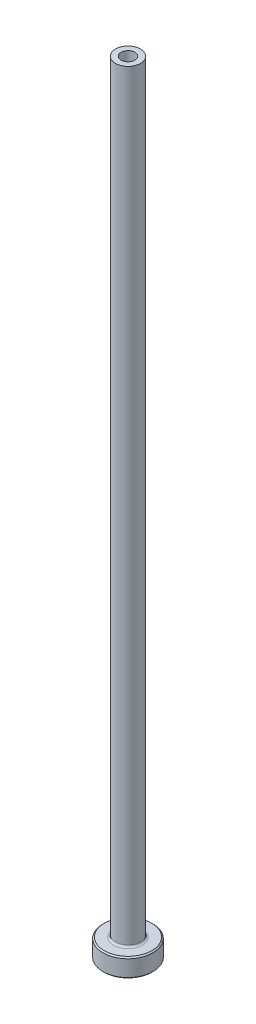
from build123d import *

# Parameters (mm, degrees)
FILLET1_R     = 0.3
CHAMFER1_SIZE = 0.2
CHAMFER3_SIZE = 0.5


with BuildPart() as part:
    # Sketch1 → Revolve1 (revolve)
    with BuildSketch(Plane.XY, mode=Mode.PRIVATE) as revolve1_sk:
        Polygon((-1.1, 125), (-2, 125), (-2, 3), (-4, 3), (-4, 0), (-1.35, 0), (-1.35, 78), (-1.1, 90), align=None)
    revolve(revolve1_sk.sketch.rotate(Axis((0, 92.187680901, 0), (0, -1, 0)), 270), axis=Axis((0, 92.187680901, 0), (0, -1, 0)))

    # Fillet1
    fillet1_edges = [part.edges().sort_by_distance(p)[0] for p in [
        (0, 3, -2),
    ]]
    fillet(fillet1_edges, radius=FILLET1_R)

    # Chamfer1
    chamfer1_edges = [part.edges().sort_by_distance(p)[0] for p in [
        (0, 0, -4),
        (0, 3, -4),
    ]]
    chamfer(chamfer1_edges, length=CHAMFER1_SIZE)

    # Chamfer3
    chamfer3_edges = [part.edges().sort_by_distance(p)[0] for p in [
        (0, 0, -1.35),
    ]]
    chamfer(chamfer3_edges, length=CHAMFER3_SIZE)


solid = part.part
